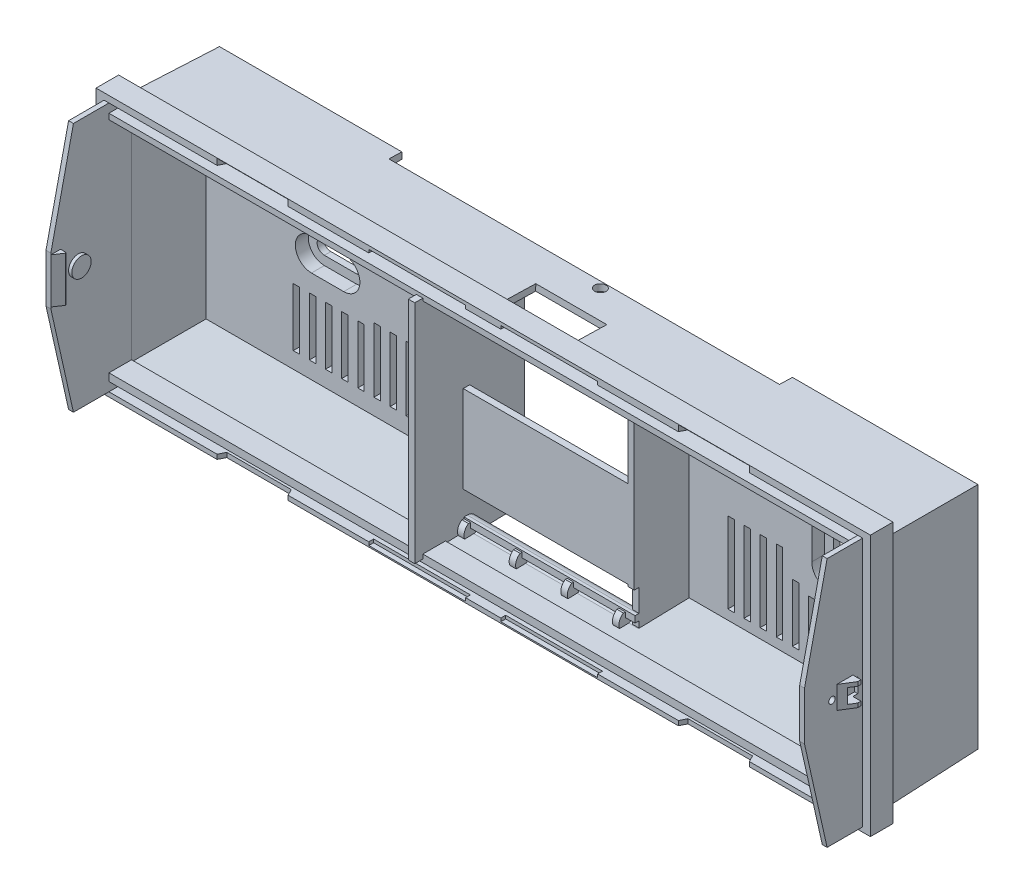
from build123d import *

# Parameters (mm, degrees)
ESQUISSE1_W                = 235
ESQUISSE1_H                = 71
EXTRUSION1_DEPTH           = 1.5
EXTRUSION2_START           = 4
ESQUISSE2_W                = 235
ESQUISSE2_H                = 71
EXTRUSION2_DEPTH           = 28.5
EXTRUSION2_DRAFT           = 1.5
ESQUISSE3_W                = 232.49259753
ESQUISSE3_H                = 68.49259753
ENL_V_MAT_EXTRU_1_DEPTH    = 22.5
ENL_V_MAT_EXTRU_1_DRAFT    = -1.5
ESQUISSE4_W                = 231
ESQUISSE4_H                = 67
ENL_V_MAT_EXTRU_2_DEPTH    = 4
ESQUISSE5_W                = 121
ESQUISSE5_H                = 4
ENL_V_MAT_EXTRU_3_DEPTH    = 40
ESQUISSE6_W                = 51
ESQUISSE6_H                = 69.851042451
ENL_V_MAT_EXTRU_4_DEPTH    = 17
ESQUISSE7_R                = 1.75
ESQUISSE7_W                = 22
ESQUISSE7_H                = 10.5
ENL_V_MAT_EXTRU_5_DEPTH    = 10
EXTRUSION3_DEPTH           = 4
ENL_V_START                = -2
ENL_V_MAT_EXTRU_6_DEPTH    = 10
ENL_V_MAT_EXTRU_7_DEPTH    = 10
ESQUISSE11_W               = 2
ESQUISSE11_H               = 70
EXTRUSION4_DEPTH           = 17
ESQUISSE12_W               = 2
ESQUISSE12_H               = 70
EXTRUSION5_DEPTH           = 32
EXTRUSION6_REACH           = 160.252
ESQUISSE13_W               = 2
ESQUISSE13_H               = 27
ENL_V_MAT_EXTRU_8_DEPTH    = 10
EXTRUSION7_REACH           = 147.967
EXTRUSION8_DEPTH           = 2
R_P_TITION_LIN_AIRE1_COUNT = 4
R_P_TITION_LIN_AIRE1_PITCH = 16
ESQUISSE17_W               = 239.903414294
ESQUISSE17_H               = 80.903414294
ESQUISSE17_W_2             = 231.903414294
ESQUISSE17_H_2             = 67.903414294
EXTRUSION9_DEPTH           = 7
ESQUISSE18_W               = 231.903414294
ESQUISSE18_H               = 2.75
ENL_V_MAT_EXTRU_9_DEPTH    = 5
ENL_V_START_2              = -2.5
ENL_V_MAT_EXTRU_10_DEPTH   = 3
ESQUISSE20_W               = 30
ESQUISSE20_H               = 1
ENL_V_MAT_EXTRU_11_DEPTH   = 1.5
EXTRUSION11_DEPTH          = 1.5
EXTRUSION12_DEPTH          = 7
EXTRUSION13_DEPTH          = 3.5
CONG_1_R                   = 0.2
ENL_V_MAT_EXTRU_12_DEPTH   = 2.25
ESQUISSE26_R               = 1
ENL_V_MAT_EXTRU_13_DEPTH   = 2
ESQUISSE27_R               = 3
EXTRUSION14_DEPTH          = 1
CONG_1_OF_SYM_TRIE3_R      = 0.2
ESQUISSE28_W               = 2
ESQUISSE28_H               = 20
ESQUISSE28_H_2             = 18
ESQUISSE28_H_3             = 25
ESQUISSE28_H_4             = 16
ESQUISSE28_H_5             = 23
ESQUISSE28_H_6             = 15
ENL_V_MAT_EXTRU_14_DEPTH   = 10


with BuildPart() as part:
    # Esquisse1 → Extrusion1 (new body)
    with BuildSketch(Plane.XY):
        with Locations((-6.5, 0)):
            Rectangle(ESQUISSE1_W, ESQUISSE1_H)
    extrude(amount=EXTRUSION1_DEPTH)


with BuildPart() as extrusion2_tool:
    # Esquisse2 → Extrusion2 (with draft: the straight prism first)
    with BuildSketch(Plane(origin=(0, 0, 0), x_dir=(-1, 0, 0), z_dir=(0, 0, -1)).offset(EXTRUSION2_START)):
        with Locations((6.5, 0)):
            Rectangle(ESQUISSE2_W, ESQUISSE2_H)
    extrude(amount=-EXTRUSION2_DEPTH)
    # Extrusion2: the draft: its side faces are tilted about the plane it starts from
    extrusion2_sides = [extrusion2_tool.faces().sort_by_distance(p)[0] for p in [
        (111, 0, 10.25),
        (-6.5, -35.5, 10.25),
        (-124, 0, 10.25),
        (-6.5, 35.5, 10.25),
    ]]
    draft(extrusion2_sides, Plane(origin=(0, 0, 0), x_dir=(-1, 0, 0), z_dir=(0, 0, -1)).offset(EXTRUSION2_START), EXTRUSION2_DRAFT)


with BuildPart() as part_1:
    add(part.part)

    # Extrusion2: add extrusion2_tool
    add(extrusion2_tool.part)


with BuildPart() as enl_v_mat_extru_1_tool:
    # Esquisse3 → Enl_v. mat.-Extru.1 (with draft: the straight prism first)
    with BuildSketch(Plane.XY.offset(24.5)):
        with Locations((-6.5, 0)):
            Rectangle(ESQUISSE3_W, ESQUISSE3_H)
    extrude(amount=-ENL_V_MAT_EXTRU_1_DEPTH)
    # Enl_v. mat.-Extru.1: the draft: its side faces are tilted about the plane it starts from
    enl_v_mat_extru_1_sides = [enl_v_mat_extru_1_tool.faces().sort_by_distance(p)[0] for p in [
        (-122.746298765, 0, 13.25),
        (-6.5, -34.246298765, 13.25),
        (109.746298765, 0, 13.25),
        (-6.5, 34.246298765, 13.25),
    ]]
    draft(enl_v_mat_extru_1_sides, Plane.XY.offset(24.5), ENL_V_MAT_EXTRU_1_DRAFT)


with BuildPart() as part_2:
    add(part_1.part)

    # Enl_v. mat.-Extru.1: cut by enl_v_mat_extru_1_tool
    add(enl_v_mat_extru_1_tool.part, mode=Mode.SUBTRACT)

    # Esquisse4 → Enl_v. mat.-Extru.2 (cut)
    with BuildSketch(Plane(origin=(0, 0, -4), x_dir=(-1, 0, 0), z_dir=(0, 0, -1))):
        with Locations((6.5, 0)):
            Rectangle(ESQUISSE4_W, ESQUISSE4_H)
    extrude(amount=-ENL_V_MAT_EXTRU_2_DEPTH, mode=Mode.SUBTRACT)

    # Esquisse5 → Enl_v. mat.-Extru.3 (cut, symmetric)
    with BuildSketch(Plane(origin=(0, 0, 0), x_dir=(1, 0, 0), z_dir=(0, 1, 0))):
        with Locations((-7, 2)):
            Rectangle(ESQUISSE5_W, ESQUISSE5_H)
    extrude(amount=ENL_V_MAT_EXTRU_3_DEPTH, both=True, mode=Mode.SUBTRACT)

    # Esquisse6 → Enl_v. mat.-Extru.4 (cut)
    with BuildSketch(Plane(origin=(0, 0, 0), x_dir=(-1, 0, 0), z_dir=(0, 0, -1))):
        with Locations((0, -1.320777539)):
            Rectangle(ESQUISSE6_W, ESQUISSE6_H)
    extrude(amount=-ENL_V_MAT_EXTRU_4_DEPTH, mode=Mode.SUBTRACT)

    # Esquisse7 → Enl_v. mat.-Extru.5 (cut)
    with BuildSketch(Plane(origin=(0, 35.580346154, -0.931704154), x_dir=(-1, 0, 0), z_dir=(0, 0.9996573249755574, -0.02617694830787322))):
        with Locations(Location((0, 2.932023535, 0), (0, 0, 90))):
            Circle(ESQUISSE7_R)
        with Locations((0, 17.182023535)):
            Rectangle(ESQUISSE7_W, ESQUISSE7_H)
    extrude(amount=-ENL_V_MAT_EXTRU_5_DEPTH, mode=Mode.SUBTRACT)

    # Esquisse8 → Extrusion3 (add)
    with BuildSketch(Plane(origin=(0, 0, 0), x_dir=(-1, 0, 0), z_dir=(0, 0, -1))):
        with BuildLine():
            Line((-78.5, 5), (-78.5, -5))
            ThreePointArc((-78.5, -5), (-70.5, -13), (-62.5, -5))
            Line((-62.5, -5), (-62.5, 5))
            ThreePointArc((-62.5, 5), (-70.5, 13), (-78.5, 5))
        make_face()
        with BuildLine():
            Line((79.5, 8), (89.5, 8))
            ThreePointArc((89.5, 8), (97.5, 0), (89.5, -8))
            Line((89.5, -8), (79.5, -8))
            ThreePointArc((79.5, -8), (71.5, 0), (79.5, 8))
        make_face()
    extrude(amount=EXTRUSION3_DEPTH)

    # Esquisse9 → Enl_v. mat.-Extru.6 (cut)
    with BuildSketch(Plane(origin=(81.698742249, 0.352113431, -4), x_dir=(-1, 0, 0), z_dir=(0, 0, -1)).offset(ENL_V_START)):
        with BuildLine():
            Line((161.198742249, 4.647886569), (171.198742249, 4.647886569))
            ThreePointArc((171.198742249, 4.647886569), (176.198742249, -0.352113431), (171.198742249, -5.352113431))
            Line((171.198742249, -5.352113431), (161.198742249, -5.352113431))
            ThreePointArc((161.198742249, -5.352113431), (156.198742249, -0.352113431), (161.198742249, 4.647886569))
        make_face()
        with BuildLine():
            Line((6.198742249, 4.647886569), (6.198742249, -5.352113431))
            ThreePointArc((6.198742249, -5.352113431), (11.198742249, -10.352113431), (16.198742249, -5.352113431))
            Line((16.198742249, -5.352113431), (16.198742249, 4.647886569))
            ThreePointArc((16.198742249, 4.647886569), (11.198742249, 9.647886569), (6.198742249, 4.647886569))
        make_face()
    extrude(amount=-ENL_V_MAT_EXTRU_6_DEPTH, mode=Mode.SUBTRACT)

    # Esquisse10 → Enl_v. mat.-Extru.7 (cut)
    with BuildSketch(Plane(origin=(0, 0, -4), x_dir=(-1, 0, 0), z_dir=(0, 0, -1))):
        with BuildLine():
            Line((-72.75, 5), (-72.75, -5))
            ThreePointArc((-72.75, -5), (-70.5, -7.25), (-68.25, -5))
            Line((-68.25, -5), (-68.25, 5))
            ThreePointArc((-68.25, 5), (-70.5, 7.25), (-72.75, 5))
        make_face()
        with BuildLine():
            Line((79.5, 2.25), (89.5, 2.25))
            ThreePointArc((89.5, 2.25), (91.75, 0), (89.5, -2.25))
            Line((89.5, -2.25), (79.5, -2.25))
            ThreePointArc((79.5, -2.25), (77.25, 0), (79.5, 2.25))
        make_face()
    extrude(amount=-ENL_V_MAT_EXTRU_7_DEPTH, mode=Mode.SUBTRACT)

    # Esquisse11 → Extrusion4 (add)
    with BuildSketch(Plane.XY.offset(2)):
        with Locations((26.5, 0)):
            Rectangle(ESQUISSE11_W, ESQUISSE11_H)
    extrude(amount=EXTRUSION4_DEPTH)

    # Esquisse12 → Extrusion5 (add)
    with BuildSketch(Plane.XY.offset(2)):
        with Locations((-26.5, 0)):
            Rectangle(ESQUISSE12_W, ESQUISSE12_H)
    extrude(amount=EXTRUSION5_DEPTH)

    # Esquisse13 → Extrusion6 (add, up to next)
    with BuildSketch(Plane.ZY.offset(-25.5), mode=Mode.PRIVATE) as extrusion6_sk1:
        with Locations((18, -9)):
            Rectangle(ESQUISSE13_W, ESQUISSE13_H)
    extrusion6_tool1 = extrude(extrusion6_sk1.sketch, amount=EXTRUSION6_REACH, mode=Mode.PRIVATE) - part_2.part
    add(extrusion6_tool1.solids().sort_by_distance((25.5, -9, 18))[0])

    # Esquisse15 → Enl_v. mat.-Extru.8 (cut)
    with BuildSketch(Plane(origin=(27.5, 0, 0), x_dir=(0, 0, -1), z_dir=(1, 0, 0))):
        Polygon((-17.5, -34.062997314), (-19, -34.102276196), (-19, -23.102276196), (-17.5, -23.102276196), align=None)
    extrude(amount=-ENL_V_MAT_EXTRU_8_DEPTH, mode=Mode.SUBTRACT)

    # Extrusion7: up to this face of the body (flat: up to its plane)
    extrusion7_end = Plane(part_2.part.faces().sort_by_distance((27.5, 0.414758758, 10.406457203))[0])
    # Esquisse14 → Extrusion7 (add, up to the picked face)
    with BuildSketch(Plane(origin=(-25.5, 0, 0), x_dir=(0, 0, -1), z_dir=(1, 0, 0)), mode=Mode.PRIVATE) as extrusion7_sk1:
        with BuildLine():
            Line((-17.75, -34.069543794), (-17.75, -36.069543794))
            ThreePointArc((-17.75, -36.069543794), (-14.75, -33.069543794), (-17.75, -30.069543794))
            Line((-17.75, -30.069543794), (-18.75, -30.069543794))
            Line((-18.75, -30.069543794), (-18.75, -32.069543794))
            Line((-18.75, -32.069543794), (-17.75, -32.069543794))
            ThreePointArc((-17.75, -32.069543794), (-16.75, -33.069543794), (-17.75, -34.069543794))
        make_face()
    extrusion7_tool1 = split(extrude(extrusion7_sk1.sketch, amount=EXTRUSION7_REACH, mode=Mode.PRIVATE), bisect_by=extrusion7_end, keep=Keep.BOTH, mode=Mode.PRIVATE)
    add(extrusion7_tool1.solids().sort_by(Axis((-25.5, -32.794939, 16.628696), (1, 0, 0)))[0])

    # Esquisse16 → Extrusion8 (add)
    with BuildSketch(Plane(origin=(-25.5, 0, 0), x_dir=(0, 0, -1), z_dir=(1, 0, 0))):
        with BuildLine():
            Line((-20.364376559, -34.540949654), (-16.364376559, -34.540949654))
            Line((-16.364376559, -34.540949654), (-16.364376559, -30.540949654))
            Line((-16.364376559, -30.540949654), (-19.364376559, -30.540949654))
            ThreePointArc((-19.364376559, -30.540949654), (-20.6604275, -32.341936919), (-20.364376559, -34.540949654))
        make_face()
    extrusion8 = extrude(amount=EXTRUSION8_DEPTH)

    # R_p_tition lin_aire1: Extrusion8 ×4
    with Locations(*[(i * R_P_TITION_LIN_AIRE1_PITCH, 0, 0) for i in range(1, R_P_TITION_LIN_AIRE1_COUNT)]):
        add(extrusion8)

    # Esquisse17 → Extrusion9 (add)
    with BuildSketch(Plane.XY.offset(24.5)):
        with Locations((-6.794591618, 0.294591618)):
            Rectangle(ESQUISSE17_W, ESQUISSE17_H)
        with Locations((-6.794591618, 0.294591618)):
            Rectangle(ESQUISSE17_W_2, ESQUISSE17_H_2, mode=Mode.SUBTRACT)
    extrude(amount=EXTRUSION9_DEPTH)

    # Esquisse18 → Enl_v. mat.-Extru.9 (cut)
    with BuildSketch(Plane.XY.offset(31.5)):
        with Locations((-6.794591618, 37.371298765)):
            Rectangle(ESQUISSE18_W, ESQUISSE18_H)
        with Locations((-6.794591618, -37.371298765)):
            Rectangle(ESQUISSE18_W, ESQUISSE18_H)
    extrude(amount=-ENL_V_MAT_EXTRU_9_DEPTH, mode=Mode.SUBTRACT)

    # Esquisse19 → Enl_v. mat.-Extru.10 (cut)
    with BuildSketch(Plane.XZ.offset(40.157115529).offset(ENL_V_START_2)):
        Polygon((-67.246298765, 31.5), (-89.246298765, 31.5), (-88.246298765, 29.5), (-68.246298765, 29.5), align=None)
        Polygon((74.657115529, 29.5), (75.657115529, 31.5), (53.657115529, 31.5), (54.657115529, 29.5), align=None)
    enl_v_mat_extru_10 = extrude(amount=ENL_V_MAT_EXTRU_10_DEPTH, mode=Mode.SUBTRACT)

    # Esquisse20 → Enl_v. mat.-Extru.11 (cut)
    with BuildSketch(Plane.XY.offset(31.5)):
        with Locations((-27.246298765, -39.246298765)):
            Rectangle(ESQUISSE20_W, ESQUISSE20_H)
        with Locations((13.657115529, -39.246298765)):
            Rectangle(ESQUISSE20_W, ESQUISSE20_H)
    enl_v_mat_extru_11 = extrude(amount=-ENL_V_MAT_EXTRU_11_DEPTH, mode=Mode.SUBTRACT)

    # Sym_trie1: Enl_v. mat.-Extru.10, Enl_v. mat.-Extru.11 across plane
    add(enl_v_mat_extru_10.mirror(Plane.ZX), mode=Mode.SUBTRACT)
    add(enl_v_mat_extru_11.mirror(Plane.ZX), mode=Mode.SUBTRACT)

    # Esquisse22 → Extrusion11 (add)
    with BuildSketch(Plane(origin=(-122.746298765, 0, 0), x_dir=(0, 0, -1), z_dir=(1, 0, 0))):
        Polygon((-31.5, -38.746298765), (-42.5, -38.746298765), (-49.5, -7.501298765), (-49.5, 7.498701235), (-42.5, 38.746298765), (-31.5, 38.746298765), align=None)
    extrusion11 = extrude(amount=-EXTRUSION11_DEPTH)

    # Esquisse23 → Extrusion12 (add, symmetric)
    with BuildSketch(Plane(origin=(0, 0, 0), x_dir=(1, 0, 0), z_dir=(0, 1, 0))):
        Polygon((-122.746298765, -49.5), (-120.746298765, -46.5), (-122.746298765, -46.5), align=None)
    extrusion12 = extrude(amount=EXTRUSION12_DEPTH, both=True)

    # Esquisse24 → Extrusion13 (add, symmetric)
    with BuildSketch(Plane(origin=(0, 0, 0), x_dir=(1, 0, 0), z_dir=(0, 1, 0))):
        Polygon((-124.246298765, -39.5), (-126.746298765, -35.5), (-126.746298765, -34.5), (-124.246298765, -34.5), align=None)
    extrusion13 = extrude(amount=EXTRUSION13_DEPTH, both=True)

    # Cong_1
    cong_1_edges = [part_2.edges().sort_by_distance(p)[0] for p in [
        (-120.746298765, 0, 46.5),
    ]]
    fillet(cong_1_edges, radius=CONG_1_R)

    # Esquisse25 → Enl_v. mat.-Extru.12 (cut, symmetric)
    with BuildSketch(Plane(origin=(0, 0, 0), x_dir=(1, 0, 0), z_dir=(0, 1, 0))):
        Polygon((-125.496298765, -37.5), (-123.246298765, -36.09375), (-123.246298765, -33), (-127.246298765, -33), (-127.246298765, -37.5), align=None)
    enl_v_mat_extru_12 = extrude(amount=ENL_V_MAT_EXTRU_12_DEPTH, both=True, mode=Mode.SUBTRACT)

    # Esquisse26 → Enl_v. mat.-Extru.13 (cut)
    with BuildSketch(Plane.ZY.offset(124.246298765)):
        with Locations(Location((41.000000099, 0, 0), (0, 0, 270))):
            Circle(ESQUISSE26_R)
    enl_v_mat_extru_13 = extrude(amount=-ENL_V_MAT_EXTRU_13_DEPTH, mode=Mode.SUBTRACT)

    # Esquisse27 → Extrusion14 (add)
    with BuildSketch(Plane(origin=(-122.746298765, 0, 0), x_dir=(0, 0, -1), z_dir=(1, 0, 0))):
        with Locations(Location((-41.000000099, 0, 0), (0, 0, 90))):
            Circle(ESQUISSE27_R)
    extrusion14 = extrude(amount=EXTRUSION14_DEPTH)

    # Sym_trie3: Extrusion11, Extrusion12, Extrusion13, Enl_v. mat.-Extru.12, Enl_v. mat.-Extru.13, Extrusion14 across plane
    add(extrusion11.mirror(Plane.ZY.offset(6.746298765)))
    add(extrusion12.mirror(Plane.ZY.offset(6.746298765)))
    add(extrusion13.mirror(Plane.ZY.offset(6.746298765)))
    add(enl_v_mat_extru_12.mirror(Plane.ZY.offset(6.746298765)), mode=Mode.SUBTRACT)
    add(enl_v_mat_extru_13.mirror(Plane.ZY.offset(6.746298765)), mode=Mode.SUBTRACT)
    add(extrusion14.mirror(Plane.ZY.offset(6.746298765)))

    # Cong_1 of Sym_trie3
    cong_1_of_sym_trie3_edges = [part_2.edges().sort_by_distance(p)[0] for p in [
        (107.253701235, 0, 46.5),
    ]]
    fillet(cong_1_of_sym_trie3_edges, radius=CONG_1_OF_SYM_TRIE3_R)

    # Esquisse28 → Enl_v. mat.-Extru.14 (cut)
    with BuildSketch(Plane.XY.offset(2)):
        with Locations((-94.157115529, 18.657115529)):
            Rectangle(ESQUISSE28_W, ESQUISSE28_H)
        with Locations((-89.157115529, 18.657115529)):
            Rectangle(ESQUISSE28_W, ESQUISSE28_H)
        with Locations((-84.157115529, 18.657115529)):
            Rectangle(ESQUISSE28_W, ESQUISSE28_H)
        with Locations((-79.157115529, 18.657115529)):
            Rectangle(ESQUISSE28_W, ESQUISSE28_H)
        with Locations((-74.157115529, 18.657115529)):
            Rectangle(ESQUISSE28_W, ESQUISSE28_H)
        with Locations((-69.157115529, 18.657115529)):
            Rectangle(ESQUISSE28_W, ESQUISSE28_H)
        with Locations((-64.157115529, 18.657115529)):
            Rectangle(ESQUISSE28_W, ESQUISSE28_H)
        with Locations((-59.157115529, 18.657115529)):
            Rectangle(ESQUISSE28_W, ESQUISSE28_H)
        with Locations((-54.157115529, 18.657115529)):
            Rectangle(ESQUISSE28_W, ESQUISSE28_H)
        with Locations((-54.157115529, -18.657115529)):
            Rectangle(ESQUISSE28_W, ESQUISSE28_H)
        with Locations((-59.157115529, -18.657115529)):
            Rectangle(ESQUISSE28_W, ESQUISSE28_H)
        with Locations((-64.157115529, -18.657115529)):
            Rectangle(ESQUISSE28_W, ESQUISSE28_H)
        with Locations((-69.157115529, -18.657115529)):
            Rectangle(ESQUISSE28_W, ESQUISSE28_H)
        with Locations((-89.157115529, -19.657115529)):
            Rectangle(ESQUISSE28_W, ESQUISSE28_H_2)
        with Locations((-94.157115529, -19.657115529)):
            Rectangle(ESQUISSE28_W, ESQUISSE28_H_2)
        with Locations((-84.157115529, -19.657115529)):
            Rectangle(ESQUISSE28_W, ESQUISSE28_H_2)
        with Locations((-79.157115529, -19.657115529)):
            Rectangle(ESQUISSE28_W, ESQUISSE28_H_2)
        with Locations((-74.157115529, -19.657115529)):
            Rectangle(ESQUISSE28_W, ESQUISSE28_H_2)
        with Locations((40.5, -18.157115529)):
            Rectangle(ESQUISSE28_W, ESQUISSE28_H_3)
        with Locations((45.5, -18.157115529)):
            Rectangle(ESQUISSE28_W, ESQUISSE28_H_3)
        with Locations((50.5, -18.157115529)):
            Rectangle(ESQUISSE28_W, ESQUISSE28_H_3)
        with Locations((55.5, -18.157115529)):
            Rectangle(ESQUISSE28_W, ESQUISSE28_H_3)
        with Locations((60.5, -21.657115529)):
            Rectangle(ESQUISSE28_W, ESQUISSE28_H_2)
        with Locations((65.5, -22.657115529)):
            Rectangle(ESQUISSE28_W, ESQUISSE28_H_4)
        with Locations((70.5, -22.657115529)):
            Rectangle(ESQUISSE28_W, ESQUISSE28_H_4)
        with Locations((75.5, -21.657115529)):
            Rectangle(ESQUISSE28_W, ESQUISSE28_H_2)
        with Locations((80.5, -18.157115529)):
            Rectangle(ESQUISSE28_W, ESQUISSE28_H_3)
        with Locations((80.5, 17.157115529)):
            Rectangle(ESQUISSE28_W, ESQUISSE28_H_5)
        with Locations((70.5, 21.157115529)):
            Rectangle(ESQUISSE28_W, ESQUISSE28_H_6)
        with Locations((75.5, 21.157115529)):
            Rectangle(ESQUISSE28_W, ESQUISSE28_H_6)
        with Locations((65.5, 21.157115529)):
            Rectangle(ESQUISSE28_W, ESQUISSE28_H_6)
        with Locations((60.5, 21.157115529)):
            Rectangle(ESQUISSE28_W, ESQUISSE28_H_6)
        with Locations((50.5, 17.157115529)):
            Rectangle(ESQUISSE28_W, ESQUISSE28_H_5)
        with Locations((55.5, 17.157115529)):
            Rectangle(ESQUISSE28_W, ESQUISSE28_H_5)
        with Locations((45.5, 17.157115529)):
            Rectangle(ESQUISSE28_W, ESQUISSE28_H_5)
        with Locations((40.5, 17.157115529)):
            Rectangle(ESQUISSE28_W, ESQUISSE28_H_5)
    extrude(amount=-ENL_V_MAT_EXTRU_14_DEPTH, mode=Mode.SUBTRACT)


solid = part_2.part
